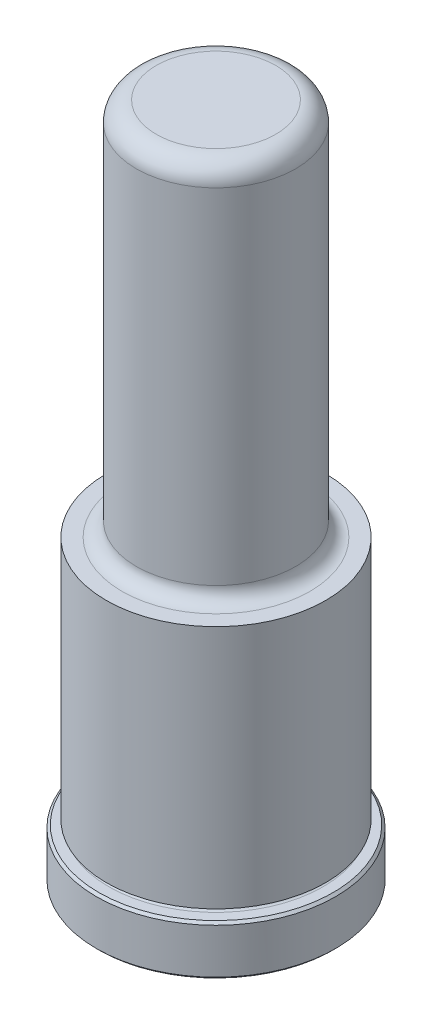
from build123d import *

# Parameters (mm, degrees)
CHAMFER1_SIZE = 0.381
FILLET7_R     = 3.175


with BuildPart() as part:
    # Sketch1 → Revolve1 (revolve)
    with BuildSketch(Plane(origin=(0, 0, 0), x_dir=(0, 0, -1), z_dir=(1, 0, 0)), mode=Mode.PRIVATE) as revolve1_sk:
        with BuildLine():
            Line((0, 0), (19.05, 0))
            Line((19.05, 0), (19.05, 7.9248))
            Line((19.05, 7.9248), (17.0688, 7.9248))
            ThreePointArc((17.0688, 7.9248), (16.6878, 8.3058), (17.0688, 8.6868))
            Line((17.0688, 8.6868), (17.4752, 8.6868))
            Line((17.4752, 8.6868), (17.4752, 47.625))
            Line((17.4752, 47.625), (14.9733, 47.625))
            ThreePointArc((14.9733, 47.625), (13.356853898, 48.294553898), (12.6873, 49.911))
            Line((12.6873, 49.911), (12.6873, 107.95))
            Line((12.6873, 107.95), (0, 107.95))
            Line((0, 107.95), (0, 0))
        make_face()
    revolve(revolve1_sk.sketch.rotate(Axis((0, 0, 0), (0, -1, 0)), 180), axis=Axis((0, 0, 0), (0, -1, 0)))

    # Chamfer1
    chamfer1_edges = [part.edges().sort_by_distance(p)[0] for p in [
        (0, 7.9248, -19.05),
        (0, 0, -19.05),
    ]]
    chamfer(chamfer1_edges, length=CHAMFER1_SIZE)

    # Fillet7
    fillet7_edges = [part.edges().sort_by_distance(p)[0] for p in [
        (0, 107.95, -12.6873),
    ]]
    fillet(fillet7_edges, radius=FILLET7_R)


solid = part.part
